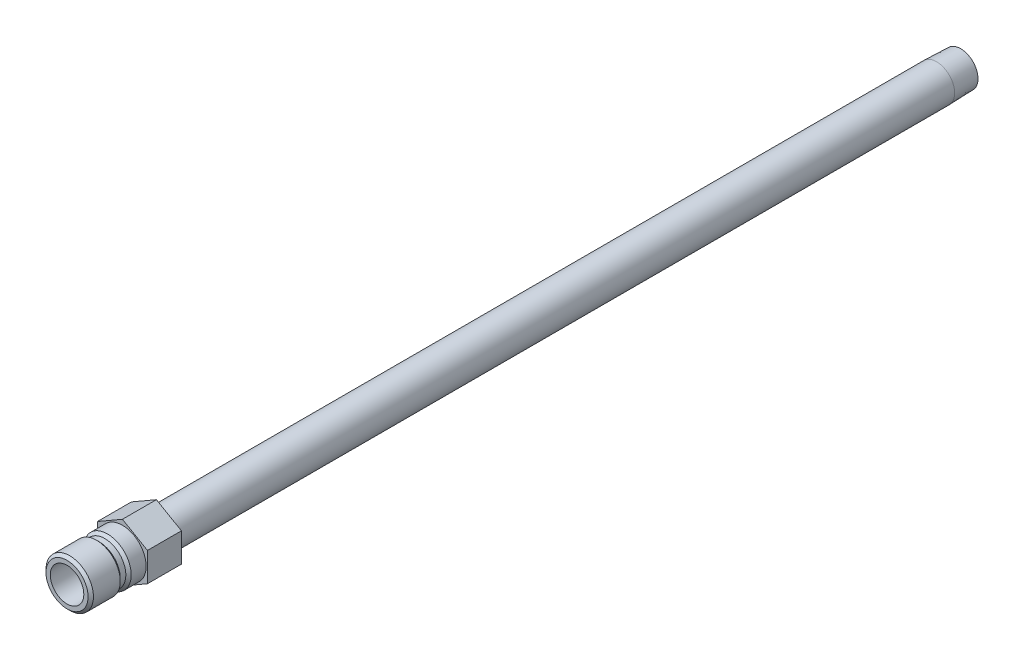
from build123d import *

# Parameters (mm, degrees)
SKETCH2_R           = 4.7625
BOSS_EXTRUDE1_DEPTH = 9.652


with BuildPart() as part:
    # Sketch1 → Revolve1 (revolve)
    with BuildSketch(Plane(origin=(0, 0, 0), x_dir=(0, 0, -1), z_dir=(1, 0, 0))):
        Polygon((-15.748, 4.7625), (-15.748, 5.9817), (-14.986, 6.7437), (-7.366, 6.7437), (-6.604, 5.9817), (-5.0165, 5.9817), (-4.2545, 6.7437), (9.652, 6.7437), (9.652, 5.1435), (231.394, 5.1435), (238.252, 4.929188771), (238.252, 3.4163), (-2.840212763, 3.4163), (-3.556, 4.7625), align=None)
    revolve(axis=Axis((0, 0, -9.652), (0, 0, 1)))

    # Sketch2 → Boss-Extrude1 (add)
    with BuildSketch(Plane.XY):
        Polygon((-7.112, 4.106115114), (-7.112, -4.106115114), (0, -8.212230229), (7.112, -4.106115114), (7.112, 4.106115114), (0, 8.212230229), align=None)
        with Locations(Location((0, 0, 0), (0, 0, 90))):
            Circle(SKETCH2_R, mode=Mode.SUBTRACT)
    extrude(amount=-BOSS_EXTRUDE1_DEPTH)


solid = part.part
